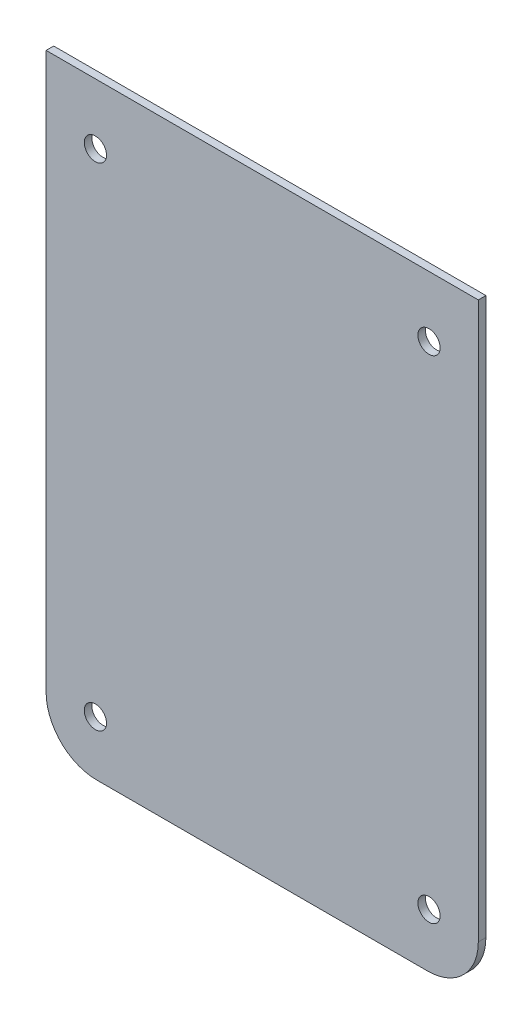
from build123d import *

# Parameters (mm, degrees)
SKETCH1_W           = 85.5
SKETCH1_H           = 120
BOSS_EXTRUDE1_DEPTH = 1.5
FILLET1_R           = 10
SKETCH2_R           = 2.2
CUT_EXTRUDE1_DEPTH  = 128.396281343


with BuildPart() as part:
    # Sketch1 → Boss-Extrude1 (new body)
    with BuildSketch(Plane.XY):
        with Locations((0, 60)):
            Rectangle(SKETCH1_W, SKETCH1_H)
    extrude(amount=-BOSS_EXTRUDE1_DEPTH)

    # Fillet1
    fillet1_edges = [part.edges().sort_by_distance(p)[0] for p in [
        (42.75, 0, -0.75),
        (-42.75, 0, -0.75),
    ]]
    fillet(fillet1_edges, radius=FILLET1_R)

    # Sketch2 → Cut-Extrude1 (cut, through all)
    with BuildSketch(Plane.XY):
        with Locations((-33, 108)):
            Circle(SKETCH2_R)
        with Locations((33, 108)):
            Circle(SKETCH2_R)
        with Locations((-33, 10.7)):
            Circle(SKETCH2_R)
        with Locations((33, 10.7)):
            Circle(SKETCH2_R)
    extrude(amount=-CUT_EXTRUDE1_DEPTH, mode=Mode.SUBTRACT)


solid = part.part
